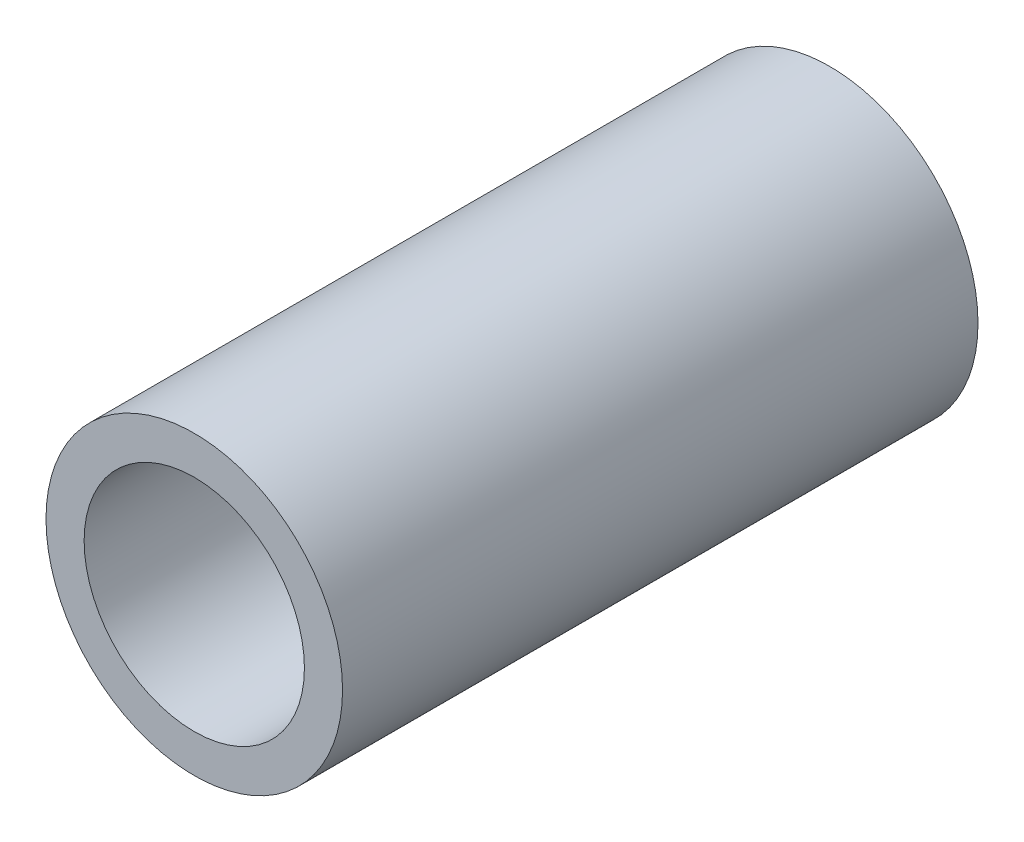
from build123d import *

# Parameters (mm, degrees)
SKETCH_1_R      = 35
SKETCH_1_R_2    = 26
EXTRUDE_1_DEPTH = 150


with BuildPart() as part:
    # Sketch 1 → Extrude 1 (new body)
    with BuildSketch(Plane.XY):
        Circle(SKETCH_1_R)
        Circle(SKETCH_1_R_2, mode=Mode.SUBTRACT)
    extrude(amount=EXTRUDE_1_DEPTH)


solid = part.part
